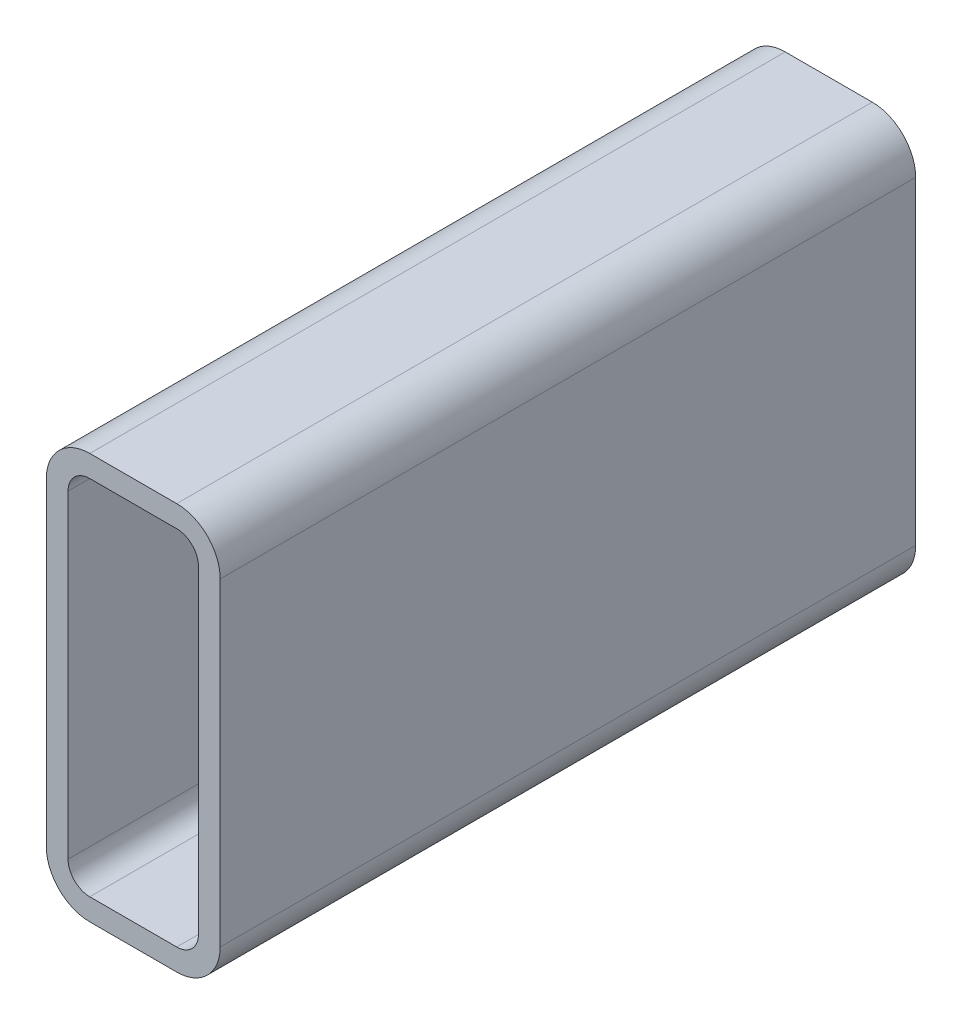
ISO-10303-21;
HEADER;
FILE_DESCRIPTION(('STEP AP214'),'2;1');
FILE_NAME('part.step','',(''),(''),'','','');
FILE_SCHEMA(('AUTOMOTIVE_DESIGN { 1 0 10303 214 1 1 1 1 }'));
ENDSEC;
DATA;
#1=APPLICATION_CONTEXT('core data for automotive mechanical design processes');
#2=APPLICATION_PROTOCOL_DEFINITION('international standard','automotive_design',2000,#1);
#3=PRODUCT_CONTEXT('',#1,'mechanical');
#4=PRODUCT('Part','Part','',(#3));
#5=PRODUCT_RELATED_PRODUCT_CATEGORY('part','',(#4));
#6=PRODUCT_DEFINITION_FORMATION('','',#4);
#7=PRODUCT_DEFINITION_CONTEXT('part definition',#1,'design');
#8=PRODUCT_DEFINITION('design','',#6,#7);
#9=PRODUCT_DEFINITION_SHAPE('','',#8);
#10=(LENGTH_UNIT() NAMED_UNIT(*) SI_UNIT(.MILLI.,.METRE.));
#11=(NAMED_UNIT(*) PLANE_ANGLE_UNIT() SI_UNIT($,.RADIAN.));
#12=(NAMED_UNIT(*) SI_UNIT($,.STERADIAN.) SOLID_ANGLE_UNIT());
#13=UNCERTAINTY_MEASURE_WITH_UNIT(LENGTH_MEASURE(1.E-05),#10,'distance_accuracy_value','');
#14=(GEOMETRIC_REPRESENTATION_CONTEXT(3) GLOBAL_UNCERTAINTY_ASSIGNED_CONTEXT((#13)) GLOBAL_UNIT_ASSIGNED_CONTEXT((#10,
#11,#12)) REPRESENTATION_CONTEXT('',''));
#15=CARTESIAN_POINT('',(0.,0.,0.));
#16=DIRECTION('',(0.,0.,1.));
#17=DIRECTION('',(1.,0.,0.));
#18=AXIS2_PLACEMENT_3D('',#15,#16,#17);
#19=CARTESIAN_POINT('',(21.5391160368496,160.739039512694,304.8));
#20=DIRECTION('',(0.,0.,1.));
#21=DIRECTION('',(1.,0.,0.));
#22=AXIS2_PLACEMENT_3D('',#19,#20,#21);
#23=PLANE('',#22);
#24=CARTESIAN_POINT('',(21.5391160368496,160.739039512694,304.8));
#25=DIRECTION('',(0.,0.,1.));
#26=DIRECTION('',(1.,0.,0.));
#27=AXIS2_PLACEMENT_3D('',#24,#25,#26);
#28=CIRCLE('',#27,19.05);
#29=CARTESIAN_POINT('',(21.5391160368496,179.789039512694,304.8));
#30=VERTEX_POINT('',#29);
#31=CARTESIAN_POINT('',(2.48911603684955,160.739039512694,304.8));
#32=VERTEX_POINT('',#31);
#33=EDGE_CURVE('E211',#30,#32,#28,.T.);
#34=ORIENTED_EDGE('',*,*,#33,.T.);
#35=DIRECTION('',(0.,-1.,0.));
#36=VECTOR('',#35,1.);
#37=CARTESIAN_POINT('',(2.48911603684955,21.0390395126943,304.8));
#38=LINE('',#37,#36);
#39=CARTESIAN_POINT('',(2.48911603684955,21.0390395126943,304.8));
#40=VERTEX_POINT('',#39);
#41=EDGE_CURVE('E214',#32,#40,#38,.T.);
#42=ORIENTED_EDGE('',*,*,#41,.T.);
#43=CARTESIAN_POINT('',(21.5391160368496,21.0390395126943,304.8));
#44=DIRECTION('',(0.,0.,1.));
#45=DIRECTION('',(1.,0.,0.));
#46=AXIS2_PLACEMENT_3D('',#43,#44,#45);
#47=CIRCLE('',#46,19.05);
#48=CARTESIAN_POINT('',(21.5391160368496,1.98903951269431,304.8));
#49=VERTEX_POINT('',#48);
#50=EDGE_CURVE('E217',#40,#49,#47,.T.);
#51=ORIENTED_EDGE('',*,*,#50,.T.);
#52=DIRECTION('',(1.,0.,0.));
#53=VECTOR('',#52,1.);
#54=CARTESIAN_POINT('',(59.6391160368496,1.98903951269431,304.8));
#55=LINE('',#54,#53);
#56=CARTESIAN_POINT('',(59.6391160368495,1.98903951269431,304.8));
#57=VERTEX_POINT('',#56);
#58=EDGE_CURVE('E219',#49,#57,#55,.T.);
#59=ORIENTED_EDGE('',*,*,#58,.T.);
#60=CARTESIAN_POINT('',(59.6391160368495,21.0390395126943,304.8));
#61=DIRECTION('',(0.,0.,1.));
#62=DIRECTION('',(1.,0.,0.));
#63=AXIS2_PLACEMENT_3D('',#60,#61,#62);
#64=CIRCLE('',#63,19.05);
#65=CARTESIAN_POINT('',(78.6891160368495,21.0390395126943,304.8));
#66=VERTEX_POINT('',#65);
#67=EDGE_CURVE('E221',#57,#66,#64,.T.);
#68=ORIENTED_EDGE('',*,*,#67,.T.);
#69=DIRECTION('',(0.,1.,0.));
#70=VECTOR('',#69,1.);
#71=CARTESIAN_POINT('',(78.6891160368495,160.739039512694,304.8));
#72=LINE('',#71,#70);
#73=CARTESIAN_POINT('',(78.6891160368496,160.739039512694,304.8));
#74=VERTEX_POINT('',#73);
#75=EDGE_CURVE('E223',#66,#74,#72,.T.);
#76=ORIENTED_EDGE('',*,*,#75,.T.);
#77=CARTESIAN_POINT('',(59.6391160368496,160.739039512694,304.8));
#78=DIRECTION('',(0.,0.,1.));
#79=DIRECTION('',(1.,0.,0.));
#80=AXIS2_PLACEMENT_3D('',#77,#78,#79);
#81=CIRCLE('',#80,19.05);
#82=CARTESIAN_POINT('',(59.6391160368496,179.789039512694,304.8));
#83=VERTEX_POINT('',#82);
#84=EDGE_CURVE('E225',#74,#83,#81,.T.);
#85=ORIENTED_EDGE('',*,*,#84,.T.);
#86=DIRECTION('',(-1.,0.,0.));
#87=VECTOR('',#86,1.);
#88=CARTESIAN_POINT('',(21.5391160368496,179.789039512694,304.8));
#89=LINE('',#88,#87);
#90=EDGE_CURVE('E227',#83,#30,#89,.T.);
#91=ORIENTED_EDGE('',*,*,#90,.T.);
#92=EDGE_LOOP('',(#34,#42,#51,#59,#68,#76,#85,#91));
#93=FACE_BOUND('',#92,.T.);
#94=DIRECTION('',(0.,-1.,0.));
#95=VECTOR('',#94,1.);
#96=CARTESIAN_POINT('',(12.0141160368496,21.0390395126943,304.8));
#97=LINE('',#96,#95);
#98=CARTESIAN_POINT('',(12.0141160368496,160.739039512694,304.8));
#99=VERTEX_POINT('',#98);
#100=CARTESIAN_POINT('',(12.0141160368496,21.0390395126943,304.8));
#101=VERTEX_POINT('',#100);
#102=EDGE_CURVE('E154',#99,#101,#97,.T.);
#103=ORIENTED_EDGE('',*,*,#102,.F.);
#104=CARTESIAN_POINT('',(21.5391160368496,160.739039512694,304.8));
#105=DIRECTION('',(0.,0.,1.));
#106=DIRECTION('',(1.,0.,0.));
#107=AXIS2_PLACEMENT_3D('',#104,#105,#106);
#108=CIRCLE('',#107,9.52500000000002);
#109=CARTESIAN_POINT('',(21.5391160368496,170.264039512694,304.8));
#110=VERTEX_POINT('',#109);
#111=EDGE_CURVE('E146',#110,#99,#108,.T.);
#112=ORIENTED_EDGE('',*,*,#111,.F.);
#113=DIRECTION('',(-1.,0.,0.));
#114=VECTOR('',#113,1.);
#115=CARTESIAN_POINT('',(21.5391160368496,170.264039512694,304.8));
#116=LINE('',#115,#114);
#117=CARTESIAN_POINT('',(59.6391160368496,170.264039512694,304.8));
#118=VERTEX_POINT('',#117);
#119=EDGE_CURVE('E179',#118,#110,#116,.T.);
#120=ORIENTED_EDGE('',*,*,#119,.F.);
#121=CARTESIAN_POINT('',(59.6391160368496,160.739039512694,304.8));
#122=DIRECTION('',(0.,0.,1.));
#123=DIRECTION('',(1.,0.,0.));
#124=AXIS2_PLACEMENT_3D('',#121,#122,#123);
#125=CIRCLE('',#124,9.52500000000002);
#126=CARTESIAN_POINT('',(69.1641160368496,160.739039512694,304.8));
#127=VERTEX_POINT('',#126);
#128=EDGE_CURVE('E177',#127,#118,#125,.T.);
#129=ORIENTED_EDGE('',*,*,#128,.F.);
#130=DIRECTION('',(0.,1.,0.));
#131=VECTOR('',#130,1.);
#132=CARTESIAN_POINT('',(69.1641160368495,160.739039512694,304.8));
#133=LINE('',#132,#131);
#134=CARTESIAN_POINT('',(69.1641160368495,21.0390395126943,304.8));
#135=VERTEX_POINT('',#134);
#136=EDGE_CURVE('E175',#135,#127,#133,.T.);
#137=ORIENTED_EDGE('',*,*,#136,.F.);
#138=CARTESIAN_POINT('',(59.6391160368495,21.0390395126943,304.8));
#139=DIRECTION('',(0.,0.,1.));
#140=DIRECTION('',(1.,0.,0.));
#141=AXIS2_PLACEMENT_3D('',#138,#139,#140);
#142=CIRCLE('',#141,9.525);
#143=CARTESIAN_POINT('',(59.6391160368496,11.5140395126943,304.8));
#144=VERTEX_POINT('',#143);
#145=EDGE_CURVE('E173',#144,#135,#142,.T.);
#146=ORIENTED_EDGE('',*,*,#145,.F.);
#147=DIRECTION('',(1.,0.,0.));
#148=VECTOR('',#147,1.);
#149=CARTESIAN_POINT('',(59.6391160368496,11.5140395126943,304.8));
#150=LINE('',#149,#148);
#151=CARTESIAN_POINT('',(21.5391160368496,11.5140395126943,304.8));
#152=VERTEX_POINT('',#151);
#153=EDGE_CURVE('E169',#152,#144,#150,.T.);
#154=ORIENTED_EDGE('',*,*,#153,.F.);
#155=CARTESIAN_POINT('',(21.5391160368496,21.0390395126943,304.8));
#156=DIRECTION('',(0.,0.,1.));
#157=DIRECTION('',(1.,0.,0.));
#158=AXIS2_PLACEMENT_3D('',#155,#156,#157);
#159=CIRCLE('',#158,9.525);
#160=EDGE_CURVE('E167',#101,#152,#159,.T.);
#161=ORIENTED_EDGE('',*,*,#160,.F.);
#162=EDGE_LOOP('',(#103,#112,#120,#129,#137,#146,#154,#161));
#163=FACE_BOUND('',#162,.T.);
#164=ADVANCED_FACE('F33',(#93,#163),#23,.T.);
#165=CARTESIAN_POINT('',(21.5391160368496,160.739039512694,0.));
#166=DIRECTION('',(0.,0.,1.));
#167=DIRECTION('',(1.,0.,0.));
#168=AXIS2_PLACEMENT_3D('',#165,#166,#167);
#169=PLANE('',#168);
#170=CARTESIAN_POINT('',(21.5391160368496,160.739039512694,0.));
#171=DIRECTION('',(0.,0.,1.));
#172=DIRECTION('',(1.,0.,0.));
#173=AXIS2_PLACEMENT_3D('',#170,#171,#172);
#174=CIRCLE('',#173,19.05);
#175=CARTESIAN_POINT('',(21.5391160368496,179.789039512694,0.));
#176=VERTEX_POINT('',#175);
#177=CARTESIAN_POINT('',(2.48911603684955,160.739039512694,0.));
#178=VERTEX_POINT('',#177);
#179=EDGE_CURVE('E162',#176,#178,#174,.T.);
#180=ORIENTED_EDGE('',*,*,#179,.F.);
#181=DIRECTION('',(-1.,0.,0.));
#182=VECTOR('',#181,1.);
#183=CARTESIAN_POINT('',(21.5391160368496,179.789039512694,0.));
#184=LINE('',#183,#182);
#185=CARTESIAN_POINT('',(59.6391160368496,179.789039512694,0.));
#186=VERTEX_POINT('',#185);
#187=EDGE_CURVE('E215',#186,#176,#184,.T.);
#188=ORIENTED_EDGE('',*,*,#187,.F.);
#189=CARTESIAN_POINT('',(59.6391160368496,160.739039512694,0.));
#190=DIRECTION('',(0.,0.,1.));
#191=DIRECTION('',(1.,0.,0.));
#192=AXIS2_PLACEMENT_3D('',#189,#190,#191);
#193=CIRCLE('',#192,19.05);
#194=CARTESIAN_POINT('',(78.6891160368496,160.739039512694,0.));
#195=VERTEX_POINT('',#194);
#196=EDGE_CURVE('E242',#195,#186,#193,.T.);
#197=ORIENTED_EDGE('',*,*,#196,.F.);
#198=DIRECTION('',(0.,1.,0.));
#199=VECTOR('',#198,1.);
#200=CARTESIAN_POINT('',(78.6891160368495,160.739039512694,0.));
#201=LINE('',#200,#199);
#202=CARTESIAN_POINT('',(78.6891160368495,21.0390395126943,0.));
#203=VERTEX_POINT('',#202);
#204=EDGE_CURVE('E240',#203,#195,#201,.T.);
#205=ORIENTED_EDGE('',*,*,#204,.F.);
#206=CARTESIAN_POINT('',(59.6391160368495,21.0390395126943,0.));
#207=DIRECTION('',(0.,0.,1.));
#208=DIRECTION('',(1.,0.,0.));
#209=AXIS2_PLACEMENT_3D('',#206,#207,#208);
#210=CIRCLE('',#209,19.05);
#211=CARTESIAN_POINT('',(59.6391160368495,1.98903951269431,0.));
#212=VERTEX_POINT('',#211);
#213=EDGE_CURVE('E238',#212,#203,#210,.T.);
#214=ORIENTED_EDGE('',*,*,#213,.F.);
#215=DIRECTION('',(1.,0.,0.));
#216=VECTOR('',#215,1.);
#217=CARTESIAN_POINT('',(59.6391160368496,1.98903951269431,0.));
#218=LINE('',#217,#216);
#219=CARTESIAN_POINT('',(21.5391160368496,1.98903951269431,0.));
#220=VERTEX_POINT('',#219);
#221=EDGE_CURVE('E236',#220,#212,#218,.T.);
#222=ORIENTED_EDGE('',*,*,#221,.F.);
#223=CARTESIAN_POINT('',(21.5391160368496,21.0390395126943,0.));
#224=DIRECTION('',(0.,0.,1.));
#225=DIRECTION('',(1.,0.,0.));
#226=AXIS2_PLACEMENT_3D('',#223,#224,#225);
#227=CIRCLE('',#226,19.05);
#228=CARTESIAN_POINT('',(2.48911603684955,21.0390395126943,0.));
#229=VERTEX_POINT('',#228);
#230=EDGE_CURVE('E234',#229,#220,#227,.T.);
#231=ORIENTED_EDGE('',*,*,#230,.F.);
#232=DIRECTION('',(0.,-1.,0.));
#233=VECTOR('',#232,1.);
#234=CARTESIAN_POINT('',(2.48911603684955,21.0390395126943,0.));
#235=LINE('',#234,#233);
#236=EDGE_CURVE('E232',#178,#229,#235,.T.);
#237=ORIENTED_EDGE('',*,*,#236,.F.);
#238=EDGE_LOOP('',(#180,#188,#197,#205,#214,#222,#231,#237));
#239=FACE_BOUND('',#238,.T.);
#240=CARTESIAN_POINT('',(21.5391160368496,160.739039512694,0.));
#241=DIRECTION('',(0.,0.,1.));
#242=DIRECTION('',(1.,0.,0.));
#243=AXIS2_PLACEMENT_3D('',#240,#241,#242);
#244=CIRCLE('',#243,9.52500000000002);
#245=CARTESIAN_POINT('',(21.5391160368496,170.264039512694,0.));
#246=VERTEX_POINT('',#245);
#247=CARTESIAN_POINT('',(12.0141160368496,160.739039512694,0.));
#248=VERTEX_POINT('',#247);
#249=EDGE_CURVE('E56',#246,#248,#244,.T.);
#250=ORIENTED_EDGE('',*,*,#249,.T.);
#251=DIRECTION('',(0.,-1.,0.));
#252=VECTOR('',#251,1.);
#253=CARTESIAN_POINT('',(12.0141160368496,21.0390395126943,0.));
#254=LINE('',#253,#252);
#255=CARTESIAN_POINT('',(12.0141160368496,21.0390395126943,0.));
#256=VERTEX_POINT('',#255);
#257=EDGE_CURVE('E161',#248,#256,#254,.T.);
#258=ORIENTED_EDGE('',*,*,#257,.T.);
#259=CARTESIAN_POINT('',(21.5391160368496,21.0390395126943,0.));
#260=DIRECTION('',(0.,0.,1.));
#261=DIRECTION('',(1.,0.,0.));
#262=AXIS2_PLACEMENT_3D('',#259,#260,#261);
#263=CIRCLE('',#262,9.525);
#264=CARTESIAN_POINT('',(21.5391160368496,11.5140395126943,0.));
#265=VERTEX_POINT('',#264);
#266=EDGE_CURVE('E183',#256,#265,#263,.T.);
#267=ORIENTED_EDGE('',*,*,#266,.T.);
#268=DIRECTION('',(1.,0.,0.));
#269=VECTOR('',#268,1.);
#270=CARTESIAN_POINT('',(59.6391160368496,11.5140395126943,0.));
#271=LINE('',#270,#269);
#272=CARTESIAN_POINT('',(59.6391160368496,11.5140395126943,0.));
#273=VERTEX_POINT('',#272);
#274=EDGE_CURVE('E186',#265,#273,#271,.T.);
#275=ORIENTED_EDGE('',*,*,#274,.T.);
#276=CARTESIAN_POINT('',(59.6391160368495,21.0390395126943,0.));
#277=DIRECTION('',(0.,0.,1.));
#278=DIRECTION('',(1.,0.,0.));
#279=AXIS2_PLACEMENT_3D('',#276,#277,#278);
#280=CIRCLE('',#279,9.525);
#281=CARTESIAN_POINT('',(69.1641160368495,21.0390395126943,0.));
#282=VERTEX_POINT('',#281);
#283=EDGE_CURVE('E189',#273,#282,#280,.T.);
#284=ORIENTED_EDGE('',*,*,#283,.T.);
#285=DIRECTION('',(0.,1.,0.));
#286=VECTOR('',#285,1.);
#287=CARTESIAN_POINT('',(69.1641160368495,160.739039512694,0.));
#288=LINE('',#287,#286);
#289=CARTESIAN_POINT('',(69.1641160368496,160.739039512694,0.));
#290=VERTEX_POINT('',#289);
#291=EDGE_CURVE('E192',#282,#290,#288,.T.);
#292=ORIENTED_EDGE('',*,*,#291,.T.);
#293=CARTESIAN_POINT('',(59.6391160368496,160.739039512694,0.));
#294=DIRECTION('',(0.,0.,1.));
#295=DIRECTION('',(1.,0.,0.));
#296=AXIS2_PLACEMENT_3D('',#293,#294,#295);
#297=CIRCLE('',#296,9.52500000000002);
#298=CARTESIAN_POINT('',(59.6391160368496,170.264039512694,0.));
#299=VERTEX_POINT('',#298);
#300=EDGE_CURVE('E195',#290,#299,#297,.T.);
#301=ORIENTED_EDGE('',*,*,#300,.T.);
#302=DIRECTION('',(-1.,0.,0.));
#303=VECTOR('',#302,1.);
#304=CARTESIAN_POINT('',(21.5391160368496,170.264039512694,0.));
#305=LINE('',#304,#303);
#306=EDGE_CURVE('E155',#299,#246,#305,.T.);
#307=ORIENTED_EDGE('',*,*,#306,.T.);
#308=EDGE_LOOP('',(#250,#258,#267,#275,#284,#292,#301,#307));
#309=FACE_BOUND('',#308,.T.);
#310=ADVANCED_FACE('F272',(#239,#309),#169,.F.);
#311=CARTESIAN_POINT('',(21.5391160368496,160.739039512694,304.8));
#312=DIRECTION('',(0.,0.,-1.));
#313=DIRECTION('',(-1.,0.,0.));
#314=AXIS2_PLACEMENT_3D('',#311,#312,#313);
#315=CYLINDRICAL_SURFACE('',#314,19.05);
#316=ORIENTED_EDGE('',*,*,#179,.T.);
#317=DIRECTION('',(0.,0.,-1.));
#318=VECTOR('',#317,1.);
#319=CARTESIAN_POINT('',(2.48911603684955,160.739039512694,304.8));
#320=LINE('',#319,#318);
#321=EDGE_CURVE('E11',#32,#178,#320,.T.);
#322=ORIENTED_EDGE('',*,*,#321,.F.);
#323=ORIENTED_EDGE('',*,*,#33,.F.);
#324=DIRECTION('',(0.,0.,-1.));
#325=VECTOR('',#324,1.);
#326=CARTESIAN_POINT('',(21.5391160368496,179.789039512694,304.8));
#327=LINE('',#326,#325);
#328=EDGE_CURVE('E229',#30,#176,#327,.T.);
#329=ORIENTED_EDGE('',*,*,#328,.T.);
#330=EDGE_LOOP('',(#316,#322,#323,#329));
#331=FACE_BOUND('',#330,.T.);
#332=ADVANCED_FACE('F35',(#331),#315,.T.);
#333=CARTESIAN_POINT('',(2.48911603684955,21.0390395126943,304.8));
#334=DIRECTION('',(1.,0.,0.));
#335=DIRECTION('',(0.,0.,-1.));
#336=AXIS2_PLACEMENT_3D('',#333,#334,#335);
#337=PLANE('',#336);
#338=ORIENTED_EDGE('',*,*,#236,.T.);
#339=DIRECTION('',(0.,0.,-1.));
#340=VECTOR('',#339,1.);
#341=CARTESIAN_POINT('',(2.48911603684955,21.0390395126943,304.8));
#342=LINE('',#341,#340);
#343=EDGE_CURVE('E41',#40,#229,#342,.T.);
#344=ORIENTED_EDGE('',*,*,#343,.F.);
#345=ORIENTED_EDGE('',*,*,#41,.F.);
#346=ORIENTED_EDGE('',*,*,#321,.T.);
#347=EDGE_LOOP('',(#338,#344,#345,#346));
#348=FACE_BOUND('',#347,.T.);
#349=ADVANCED_FACE('F289',(#348),#337,.F.);
#350=CARTESIAN_POINT('',(21.5391160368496,21.0390395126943,304.8));
#351=DIRECTION('',(0.,0.,-1.));
#352=DIRECTION('',(-1.,0.,0.));
#353=AXIS2_PLACEMENT_3D('',#350,#351,#352);
#354=CYLINDRICAL_SURFACE('',#353,19.05);
#355=ORIENTED_EDGE('',*,*,#230,.T.);
#356=DIRECTION('',(0.,0.,-1.));
#357=VECTOR('',#356,1.);
#358=CARTESIAN_POINT('',(21.5391160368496,1.98903951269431,304.8));
#359=LINE('',#358,#357);
#360=EDGE_CURVE('E259',#49,#220,#359,.T.);
#361=ORIENTED_EDGE('',*,*,#360,.F.);
#362=ORIENTED_EDGE('',*,*,#50,.F.);
#363=ORIENTED_EDGE('',*,*,#343,.T.);
#364=EDGE_LOOP('',(#355,#361,#362,#363));
#365=FACE_BOUND('',#364,.T.);
#366=ADVANCED_FACE('F266',(#365),#354,.T.);
#367=CARTESIAN_POINT('',(59.6391160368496,1.98903951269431,304.8));
#368=DIRECTION('',(0.,1.,0.));
#369=DIRECTION('',(0.,0.,1.));
#370=AXIS2_PLACEMENT_3D('',#367,#368,#369);
#371=PLANE('',#370);
#372=ORIENTED_EDGE('',*,*,#221,.T.);
#373=DIRECTION('',(0.,0.,-1.));
#374=VECTOR('',#373,1.);
#375=CARTESIAN_POINT('',(59.6391160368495,1.98903951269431,304.8));
#376=LINE('',#375,#374);
#377=EDGE_CURVE('E256',#57,#212,#376,.T.);
#378=ORIENTED_EDGE('',*,*,#377,.F.);
#379=ORIENTED_EDGE('',*,*,#58,.F.);
#380=ORIENTED_EDGE('',*,*,#360,.T.);
#381=EDGE_LOOP('',(#372,#378,#379,#380));
#382=FACE_BOUND('',#381,.T.);
#383=ADVANCED_FACE('F278',(#382),#371,.F.);
#384=CARTESIAN_POINT('',(59.6391160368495,21.0390395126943,304.8));
#385=DIRECTION('',(0.,0.,-1.));
#386=DIRECTION('',(-1.,0.,0.));
#387=AXIS2_PLACEMENT_3D('',#384,#385,#386);
#388=CYLINDRICAL_SURFACE('',#387,19.05);
#389=ORIENTED_EDGE('',*,*,#213,.T.);
#390=DIRECTION('',(0.,0.,-1.));
#391=VECTOR('',#390,1.);
#392=CARTESIAN_POINT('',(78.6891160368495,21.0390395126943,304.8));
#393=LINE('',#392,#391);
#394=EDGE_CURVE('E253',#66,#203,#393,.T.);
#395=ORIENTED_EDGE('',*,*,#394,.F.);
#396=ORIENTED_EDGE('',*,*,#67,.F.);
#397=ORIENTED_EDGE('',*,*,#377,.T.);
#398=EDGE_LOOP('',(#389,#395,#396,#397));
#399=FACE_BOUND('',#398,.T.);
#400=ADVANCED_FACE('F282',(#399),#388,.T.);
#401=CARTESIAN_POINT('',(78.6891160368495,160.739039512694,304.8));
#402=DIRECTION('',(-1.,0.,0.));
#403=DIRECTION('',(0.,0.,1.));
#404=AXIS2_PLACEMENT_3D('',#401,#402,#403);
#405=PLANE('',#404);
#406=ORIENTED_EDGE('',*,*,#204,.T.);
#407=DIRECTION('',(0.,0.,-1.));
#408=VECTOR('',#407,1.);
#409=CARTESIAN_POINT('',(78.6891160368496,160.739039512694,304.8));
#410=LINE('',#409,#408);
#411=EDGE_CURVE('E250',#74,#195,#410,.T.);
#412=ORIENTED_EDGE('',*,*,#411,.F.);
#413=ORIENTED_EDGE('',*,*,#75,.F.);
#414=ORIENTED_EDGE('',*,*,#394,.T.);
#415=EDGE_LOOP('',(#406,#412,#413,#414));
#416=FACE_BOUND('',#415,.T.);
#417=ADVANCED_FACE('F302',(#416),#405,.F.);
#418=CARTESIAN_POINT('',(59.6391160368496,160.739039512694,304.8));
#419=DIRECTION('',(0.,0.,-1.));
#420=DIRECTION('',(-1.,0.,0.));
#421=AXIS2_PLACEMENT_3D('',#418,#419,#420);
#422=CYLINDRICAL_SURFACE('',#421,19.05);
#423=ORIENTED_EDGE('',*,*,#196,.T.);
#424=DIRECTION('',(0.,0.,-1.));
#425=VECTOR('',#424,1.);
#426=CARTESIAN_POINT('',(59.6391160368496,179.789039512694,304.8));
#427=LINE('',#426,#425);
#428=EDGE_CURVE('E247',#83,#186,#427,.T.);
#429=ORIENTED_EDGE('',*,*,#428,.F.);
#430=ORIENTED_EDGE('',*,*,#84,.F.);
#431=ORIENTED_EDGE('',*,*,#411,.T.);
#432=EDGE_LOOP('',(#423,#429,#430,#431));
#433=FACE_BOUND('',#432,.T.);
#434=ADVANCED_FACE('F300',(#433),#422,.T.);
#435=CARTESIAN_POINT('',(21.5391160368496,179.789039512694,304.8));
#436=DIRECTION('',(0.,-1.,0.));
#437=DIRECTION('',(0.,0.,-1.));
#438=AXIS2_PLACEMENT_3D('',#435,#436,#437);
#439=PLANE('',#438);
#440=ORIENTED_EDGE('',*,*,#187,.T.);
#441=ORIENTED_EDGE('',*,*,#328,.F.);
#442=ORIENTED_EDGE('',*,*,#90,.F.);
#443=ORIENTED_EDGE('',*,*,#428,.T.);
#444=EDGE_LOOP('',(#440,#441,#442,#443));
#445=FACE_BOUND('',#444,.T.);
#446=ADVANCED_FACE('F295',(#445),#439,.F.);
#447=CARTESIAN_POINT('',(21.5391160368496,160.739039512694,304.8));
#448=DIRECTION('',(0.,0.,-1.));
#449=DIRECTION('',(-1.,0.,0.));
#450=AXIS2_PLACEMENT_3D('',#447,#448,#449);
#451=CYLINDRICAL_SURFACE('',#450,9.52500000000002);
#452=ORIENTED_EDGE('',*,*,#249,.F.);
#453=DIRECTION('',(0.,0.,-1.));
#454=VECTOR('',#453,1.);
#455=CARTESIAN_POINT('',(21.5391160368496,170.264039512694,304.8));
#456=LINE('',#455,#454);
#457=EDGE_CURVE('E150',#110,#246,#456,.T.);
#458=ORIENTED_EDGE('',*,*,#457,.F.);
#459=ORIENTED_EDGE('',*,*,#111,.T.);
#460=DIRECTION('',(0.,0.,-1.));
#461=VECTOR('',#460,1.);
#462=CARTESIAN_POINT('',(12.0141160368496,160.739039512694,304.8));
#463=LINE('',#462,#461);
#464=EDGE_CURVE('E149',#99,#248,#463,.T.);
#465=ORIENTED_EDGE('',*,*,#464,.T.);
#466=EDGE_LOOP('',(#452,#458,#459,#465));
#467=FACE_BOUND('',#466,.T.);
#468=ADVANCED_FACE('F148',(#467),#451,.F.);
#469=CARTESIAN_POINT('',(12.0141160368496,21.0390395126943,304.8));
#470=DIRECTION('',(1.,0.,0.));
#471=DIRECTION('',(0.,0.,-1.));
#472=AXIS2_PLACEMENT_3D('',#469,#470,#471);
#473=PLANE('',#472);
#474=ORIENTED_EDGE('',*,*,#257,.F.);
#475=ORIENTED_EDGE('',*,*,#464,.F.);
#476=ORIENTED_EDGE('',*,*,#102,.T.);
#477=DIRECTION('',(0.,0.,-1.));
#478=VECTOR('',#477,1.);
#479=CARTESIAN_POINT('',(12.0141160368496,21.0390395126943,304.8));
#480=LINE('',#479,#478);
#481=EDGE_CURVE('E163',#101,#256,#480,.T.);
#482=ORIENTED_EDGE('',*,*,#481,.T.);
#483=EDGE_LOOP('',(#474,#475,#476,#482));
#484=FACE_BOUND('',#483,.T.);
#485=ADVANCED_FACE('F158',(#484),#473,.T.);
#486=CARTESIAN_POINT('',(21.5391160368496,21.0390395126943,304.8));
#487=DIRECTION('',(0.,0.,-1.));
#488=DIRECTION('',(-1.,0.,0.));
#489=AXIS2_PLACEMENT_3D('',#486,#487,#488);
#490=CYLINDRICAL_SURFACE('',#489,9.525);
#491=ORIENTED_EDGE('',*,*,#266,.F.);
#492=ORIENTED_EDGE('',*,*,#481,.F.);
#493=ORIENTED_EDGE('',*,*,#160,.T.);
#494=DIRECTION('',(0.,0.,-1.));
#495=VECTOR('',#494,1.);
#496=CARTESIAN_POINT('',(21.5391160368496,11.5140395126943,304.8));
#497=LINE('',#496,#495);
#498=EDGE_CURVE('E208',#152,#265,#497,.T.);
#499=ORIENTED_EDGE('',*,*,#498,.T.);
#500=EDGE_LOOP('',(#491,#492,#493,#499));
#501=FACE_BOUND('',#500,.T.);
#502=ADVANCED_FACE('F327',(#501),#490,.F.);
#503=CARTESIAN_POINT('',(59.6391160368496,11.5140395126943,304.8));
#504=DIRECTION('',(0.,1.,0.));
#505=DIRECTION('',(0.,0.,1.));
#506=AXIS2_PLACEMENT_3D('',#503,#504,#505);
#507=PLANE('',#506);
#508=ORIENTED_EDGE('',*,*,#274,.F.);
#509=ORIENTED_EDGE('',*,*,#498,.F.);
#510=ORIENTED_EDGE('',*,*,#153,.T.);
#511=DIRECTION('',(0.,0.,-1.));
#512=VECTOR('',#511,1.);
#513=CARTESIAN_POINT('',(59.6391160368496,11.5140395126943,304.8));
#514=LINE('',#513,#512);
#515=EDGE_CURVE('E206',#144,#273,#514,.T.);
#516=ORIENTED_EDGE('',*,*,#515,.T.);
#517=EDGE_LOOP('',(#508,#509,#510,#516));
#518=FACE_BOUND('',#517,.T.);
#519=ADVANCED_FACE('F331',(#518),#507,.T.);
#520=CARTESIAN_POINT('',(59.6391160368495,21.0390395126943,304.8));
#521=DIRECTION('',(0.,0.,-1.));
#522=DIRECTION('',(-1.,0.,0.));
#523=AXIS2_PLACEMENT_3D('',#520,#521,#522);
#524=CYLINDRICAL_SURFACE('',#523,9.525);
#525=ORIENTED_EDGE('',*,*,#283,.F.);
#526=ORIENTED_EDGE('',*,*,#515,.F.);
#527=ORIENTED_EDGE('',*,*,#145,.T.);
#528=DIRECTION('',(0.,0.,-1.));
#529=VECTOR('',#528,1.);
#530=CARTESIAN_POINT('',(69.1641160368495,21.0390395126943,304.8));
#531=LINE('',#530,#529);
#532=EDGE_CURVE('E204',#135,#282,#531,.T.);
#533=ORIENTED_EDGE('',*,*,#532,.T.);
#534=EDGE_LOOP('',(#525,#526,#527,#533));
#535=FACE_BOUND('',#534,.T.);
#536=ADVANCED_FACE('F337',(#535),#524,.F.);
#537=CARTESIAN_POINT('',(69.1641160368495,160.739039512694,304.8));
#538=DIRECTION('',(-1.,0.,0.));
#539=DIRECTION('',(0.,0.,1.));
#540=AXIS2_PLACEMENT_3D('',#537,#538,#539);
#541=PLANE('',#540);
#542=ORIENTED_EDGE('',*,*,#291,.F.);
#543=ORIENTED_EDGE('',*,*,#532,.F.);
#544=ORIENTED_EDGE('',*,*,#136,.T.);
#545=DIRECTION('',(0.,0.,-1.));
#546=VECTOR('',#545,1.);
#547=CARTESIAN_POINT('',(69.1641160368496,160.739039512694,304.8));
#548=LINE('',#547,#546);
#549=EDGE_CURVE('E202',#127,#290,#548,.T.);
#550=ORIENTED_EDGE('',*,*,#549,.T.);
#551=EDGE_LOOP('',(#542,#543,#544,#550));
#552=FACE_BOUND('',#551,.T.);
#553=ADVANCED_FACE('F341',(#552),#541,.T.);
#554=CARTESIAN_POINT('',(59.6391160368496,160.739039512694,304.8));
#555=DIRECTION('',(0.,0.,-1.));
#556=DIRECTION('',(-1.,0.,0.));
#557=AXIS2_PLACEMENT_3D('',#554,#555,#556);
#558=CYLINDRICAL_SURFACE('',#557,9.52500000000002);
#559=ORIENTED_EDGE('',*,*,#300,.F.);
#560=ORIENTED_EDGE('',*,*,#549,.F.);
#561=ORIENTED_EDGE('',*,*,#128,.T.);
#562=DIRECTION('',(0.,0.,-1.));
#563=VECTOR('',#562,1.);
#564=CARTESIAN_POINT('',(59.6391160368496,170.264039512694,304.8));
#565=LINE('',#564,#563);
#566=EDGE_CURVE('E48',#118,#299,#565,.T.);
#567=ORIENTED_EDGE('',*,*,#566,.T.);
#568=EDGE_LOOP('',(#559,#560,#561,#567));
#569=FACE_BOUND('',#568,.T.);
#570=ADVANCED_FACE('F345',(#569),#558,.F.);
#571=CARTESIAN_POINT('',(21.5391160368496,170.264039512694,304.8));
#572=DIRECTION('',(0.,-1.,0.));
#573=DIRECTION('',(0.,0.,-1.));
#574=AXIS2_PLACEMENT_3D('',#571,#572,#573);
#575=PLANE('',#574);
#576=ORIENTED_EDGE('',*,*,#306,.F.);
#577=ORIENTED_EDGE('',*,*,#566,.F.);
#578=ORIENTED_EDGE('',*,*,#119,.T.);
#579=ORIENTED_EDGE('',*,*,#457,.T.);
#580=EDGE_LOOP('',(#576,#577,#578,#579));
#581=FACE_BOUND('',#580,.T.);
#582=ADVANCED_FACE('F349',(#581),#575,.T.);
#583=CLOSED_SHELL('',(#164,#310,#332,#349,#366,#383,#400,#417,#434,#446,#468,#485,#502,#519,
#536,#553,#570,#582));
#584=MANIFOLD_SOLID_BREP('B2',#583);
#585=ADVANCED_BREP_SHAPE_REPRESENTATION('',(#18,#584),#14);
#586=SHAPE_DEFINITION_REPRESENTATION(#9,#585);
ENDSEC;
END-ISO-10303-21;
